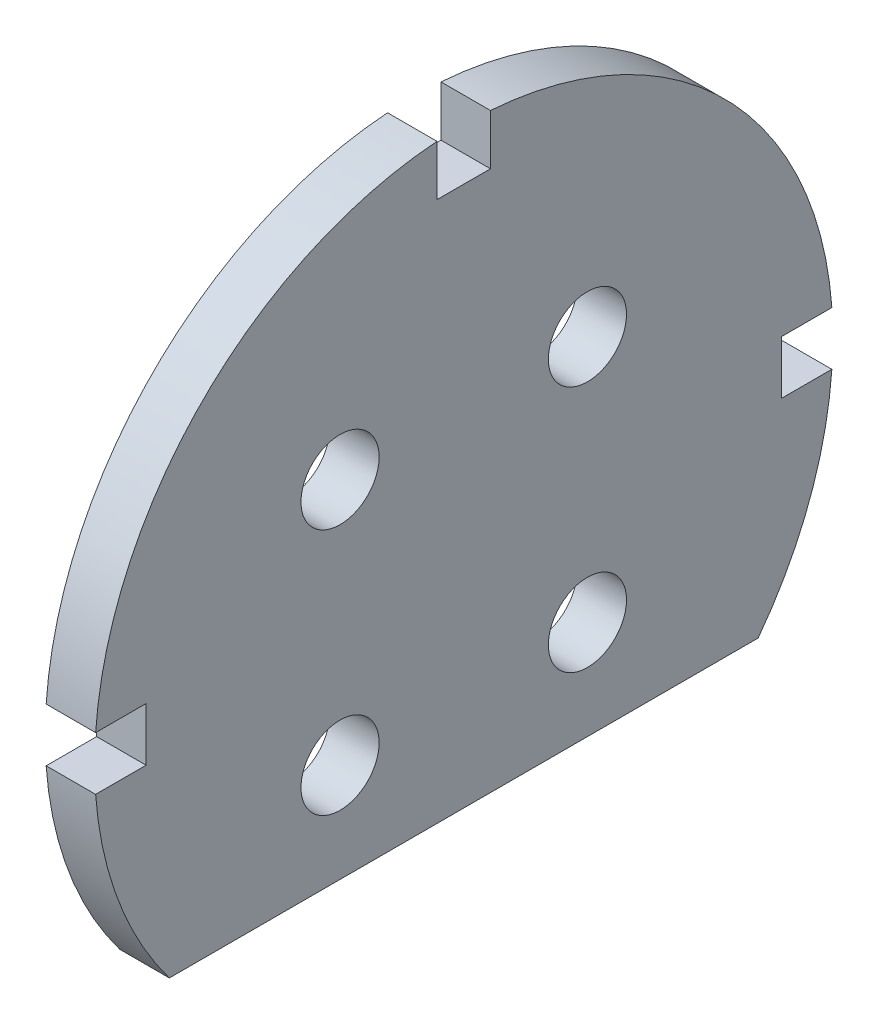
ISO-10303-21;
HEADER;
FILE_DESCRIPTION(('STEP AP214'),'2;1');
FILE_NAME('part.step','',(''),(''),'','','');
FILE_SCHEMA(('AUTOMOTIVE_DESIGN { 1 0 10303 214 1 1 1 1 }'));
ENDSEC;
DATA;
#1=APPLICATION_CONTEXT('core data for automotive mechanical design processes');
#2=APPLICATION_PROTOCOL_DEFINITION('international standard','automotive_design',2000,#1);
#3=PRODUCT_CONTEXT('',#1,'mechanical');
#4=PRODUCT('Part','Part','',(#3));
#5=PRODUCT_RELATED_PRODUCT_CATEGORY('part','',(#4));
#6=PRODUCT_DEFINITION_FORMATION('','',#4);
#7=PRODUCT_DEFINITION_CONTEXT('part definition',#1,'design');
#8=PRODUCT_DEFINITION('design','',#6,#7);
#9=PRODUCT_DEFINITION_SHAPE('','',#8);
#10=(LENGTH_UNIT() NAMED_UNIT(*) SI_UNIT(.MILLI.,.METRE.));
#11=(NAMED_UNIT(*) PLANE_ANGLE_UNIT() SI_UNIT($,.RADIAN.));
#12=(NAMED_UNIT(*) SI_UNIT($,.STERADIAN.) SOLID_ANGLE_UNIT());
#13=UNCERTAINTY_MEASURE_WITH_UNIT(LENGTH_MEASURE(1.E-05),#10,'distance_accuracy_value','');
#14=(GEOMETRIC_REPRESENTATION_CONTEXT(3) GLOBAL_UNCERTAINTY_ASSIGNED_CONTEXT((#13)) GLOBAL_UNIT_ASSIGNED_CONTEXT((#10,
#11,#12)) REPRESENTATION_CONTEXT('',''));
#15=CARTESIAN_POINT('',(0.,0.,0.));
#16=DIRECTION('',(0.,0.,1.));
#17=DIRECTION('',(1.,0.,0.));
#18=AXIS2_PLACEMENT_3D('',#15,#16,#17);
#19=CARTESIAN_POINT('',(6.35,0.,0.));
#20=DIRECTION('',(-1.,0.,0.));
#21=DIRECTION('',(0.,0.,1.));
#22=AXIS2_PLACEMENT_3D('',#19,#20,#21);
#23=CYLINDRICAL_SURFACE('',#22,47.371);
#24=CARTESIAN_POINT('',(0.,0.,0.));
#25=DIRECTION('',(1.,0.,0.));
#26=DIRECTION('',(0.,0.,-1.));
#27=AXIS2_PLACEMENT_3D('',#24,#25,#26);
#28=CIRCLE('',#27,47.371);
#29=CARTESIAN_POINT('',(0.,3.429,-47.2467311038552));
#30=VERTEX_POINT('',#29);
#31=CARTESIAN_POINT('',(0.,47.2467311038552,-3.429));
#32=VERTEX_POINT('',#31);
#33=EDGE_CURVE('E310',#30,#32,#28,.T.);
#34=ORIENTED_EDGE('',*,*,#33,.T.);
#35=DIRECTION('',(-1.,0.,0.));
#36=VECTOR('',#35,1.);
#37=CARTESIAN_POINT('',(6.35,47.2467311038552,-3.429));
#38=LINE('',#37,#36);
#39=CARTESIAN_POINT('',(6.35,47.2467311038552,-3.429));
#40=VERTEX_POINT('',#39);
#41=EDGE_CURVE('E160',#32,#40,#38,.F.);
#42=ORIENTED_EDGE('',*,*,#41,.T.);
#43=CARTESIAN_POINT('',(6.35,0.,0.));
#44=DIRECTION('',(1.,0.,0.));
#45=DIRECTION('',(0.,0.,-1.));
#46=AXIS2_PLACEMENT_3D('',#43,#44,#45);
#47=CIRCLE('',#46,47.371);
#48=CARTESIAN_POINT('',(6.35,3.429,-47.2467311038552));
#49=VERTEX_POINT('',#48);
#50=EDGE_CURVE('E303',#49,#40,#47,.T.);
#51=ORIENTED_EDGE('',*,*,#50,.F.);
#52=DIRECTION('',(-1.,0.,0.));
#53=VECTOR('',#52,1.);
#54=CARTESIAN_POINT('',(6.35,3.429,-47.2467311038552));
#55=LINE('',#54,#53);
#56=EDGE_CURVE('E239',#49,#30,#55,.T.);
#57=ORIENTED_EDGE('',*,*,#56,.T.);
#58=EDGE_LOOP('',(#34,#42,#51,#57));
#59=FACE_BOUND('',#58,.T.);
#60=ADVANCED_FACE('F42',(#59),#23,.T.);
#61=CARTESIAN_POINT('',(6.35,-3.429,47.2467311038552));
#62=VERTEX_POINT('',#61);
#63=CARTESIAN_POINT('',(6.35,-28.575,37.7820197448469));
#64=VERTEX_POINT('',#63);
#65=EDGE_CURVE('E309',#62,#64,#47,.T.);
#66=ORIENTED_EDGE('',*,*,#65,.F.);
#67=DIRECTION('',(-1.,0.,0.));
#68=VECTOR('',#67,1.);
#69=CARTESIAN_POINT('',(6.35,-3.429,47.2467311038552));
#70=LINE('',#69,#68);
#71=CARTESIAN_POINT('',(0.,-3.429,47.2467311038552));
#72=VERTEX_POINT('',#71);
#73=EDGE_CURVE('E246',#62,#72,#70,.T.);
#74=ORIENTED_EDGE('',*,*,#73,.T.);
#75=CARTESIAN_POINT('',(0.,-28.575,37.7820197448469));
#76=VERTEX_POINT('',#75);
#77=EDGE_CURVE('E295',#72,#76,#28,.T.);
#78=ORIENTED_EDGE('',*,*,#77,.T.);
#79=DIRECTION('',(1.,0.,0.));
#80=VECTOR('',#79,1.);
#81=CARTESIAN_POINT('',(0.,-28.575,37.7820197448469));
#82=LINE('',#81,#80);
#83=EDGE_CURVE('E291',#76,#64,#82,.T.);
#84=ORIENTED_EDGE('',*,*,#83,.T.);
#85=EDGE_LOOP('',(#66,#74,#78,#84));
#86=FACE_BOUND('',#85,.T.);
#87=ADVANCED_FACE('F322',(#86),#23,.T.);
#88=CARTESIAN_POINT('',(6.35,47.2467311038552,3.429));
#89=VERTEX_POINT('',#88);
#90=CARTESIAN_POINT('',(6.35,3.429,47.2467311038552));
#91=VERTEX_POINT('',#90);
#92=EDGE_CURVE('E304',#89,#91,#47,.T.);
#93=ORIENTED_EDGE('',*,*,#92,.F.);
#94=DIRECTION('',(-1.,0.,0.));
#95=VECTOR('',#94,1.);
#96=CARTESIAN_POINT('',(6.35,47.2467311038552,3.429));
#97=LINE('',#96,#95);
#98=CARTESIAN_POINT('',(0.,47.2467311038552,3.429));
#99=VERTEX_POINT('',#98);
#100=EDGE_CURVE('E153',#89,#99,#97,.T.);
#101=ORIENTED_EDGE('',*,*,#100,.T.);
#102=CARTESIAN_POINT('',(0.,3.429,47.2467311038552));
#103=VERTEX_POINT('',#102);
#104=EDGE_CURVE('E66',#99,#103,#28,.T.);
#105=ORIENTED_EDGE('',*,*,#104,.T.);
#106=DIRECTION('',(-1.,0.,0.));
#107=VECTOR('',#106,1.);
#108=CARTESIAN_POINT('',(6.35,3.429,47.2467311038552));
#109=LINE('',#108,#107);
#110=EDGE_CURVE('E243',#103,#91,#109,.F.);
#111=ORIENTED_EDGE('',*,*,#110,.T.);
#112=EDGE_LOOP('',(#93,#101,#105,#111));
#113=FACE_BOUND('',#112,.T.);
#114=ADVANCED_FACE('F370',(#113),#23,.T.);
#115=CARTESIAN_POINT('',(0.,-28.575,-37.7820197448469));
#116=VERTEX_POINT('',#115);
#117=CARTESIAN_POINT('',(0.,-3.429,-47.2467311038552));
#118=VERTEX_POINT('',#117);
#119=EDGE_CURVE('E305',#116,#118,#28,.T.);
#120=ORIENTED_EDGE('',*,*,#119,.T.);
#121=DIRECTION('',(-1.,0.,0.));
#122=VECTOR('',#121,1.);
#123=CARTESIAN_POINT('',(6.35,-3.429,-47.2467311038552));
#124=LINE('',#123,#122);
#125=CARTESIAN_POINT('',(6.35,-3.429,-47.2467311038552));
#126=VERTEX_POINT('',#125);
#127=EDGE_CURVE('E210',#118,#126,#124,.F.);
#128=ORIENTED_EDGE('',*,*,#127,.T.);
#129=CARTESIAN_POINT('',(6.35,-28.575,-37.7820197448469));
#130=VERTEX_POINT('',#129);
#131=EDGE_CURVE('E298',#130,#126,#47,.T.);
#132=ORIENTED_EDGE('',*,*,#131,.F.);
#133=DIRECTION('',(1.,0.,0.));
#134=VECTOR('',#133,1.);
#135=CARTESIAN_POINT('',(0.,-28.575,-37.7820197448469));
#136=LINE('',#135,#134);
#137=EDGE_CURVE('E287',#116,#130,#136,.T.);
#138=ORIENTED_EDGE('',*,*,#137,.F.);
#139=EDGE_LOOP('',(#120,#128,#132,#138));
#140=FACE_BOUND('',#139,.T.);
#141=ADVANCED_FACE('F44',(#140),#23,.T.);
#142=CARTESIAN_POINT('',(6.35,0.,0.));
#143=DIRECTION('',(1.,0.,0.));
#144=DIRECTION('',(0.,0.,-1.));
#145=AXIS2_PLACEMENT_3D('',#142,#143,#144);
#146=PLANE('',#145);
#147=DIRECTION('',(0.,1.,0.));
#148=VECTOR('',#147,1.);
#149=CARTESIAN_POINT('',(6.35,53.975,-3.429));
#150=LINE('',#149,#148);
#151=CARTESIAN_POINT('',(6.35,40.767,-3.429));
#152=VERTEX_POINT('',#151);
#153=EDGE_CURVE('E172',#152,#40,#150,.T.);
#154=ORIENTED_EDGE('',*,*,#153,.F.);
#155=DIRECTION('',(0.,0.,-1.));
#156=VECTOR('',#155,1.);
#157=CARTESIAN_POINT('',(6.35,40.767,3.429));
#158=LINE('',#157,#156);
#159=CARTESIAN_POINT('',(6.35,40.767,3.429));
#160=VERTEX_POINT('',#159);
#161=EDGE_CURVE('E149',#160,#152,#158,.T.);
#162=ORIENTED_EDGE('',*,*,#161,.F.);
#163=DIRECTION('',(0.,-1.,0.));
#164=VECTOR('',#163,1.);
#165=CARTESIAN_POINT('',(6.35,53.975,3.429));
#166=LINE('',#165,#164);
#167=EDGE_CURVE('E175',#89,#160,#166,.T.);
#168=ORIENTED_EDGE('',*,*,#167,.F.);
#169=ORIENTED_EDGE('',*,*,#92,.T.);
#170=DIRECTION('',(0.,0.,1.));
#171=VECTOR('',#170,1.);
#172=CARTESIAN_POINT('',(6.35,3.429,53.975));
#173=LINE('',#172,#171);
#174=CARTESIAN_POINT('',(6.35,3.429,40.767));
#175=VERTEX_POINT('',#174);
#176=EDGE_CURVE('E199',#175,#91,#173,.T.);
#177=ORIENTED_EDGE('',*,*,#176,.F.);
#178=DIRECTION('',(0.,1.,0.));
#179=VECTOR('',#178,1.);
#180=CARTESIAN_POINT('',(6.35,-3.429,40.767));
#181=LINE('',#180,#179);
#182=CARTESIAN_POINT('',(6.35,-3.429,40.767));
#183=VERTEX_POINT('',#182);
#184=EDGE_CURVE('E195',#183,#175,#181,.T.);
#185=ORIENTED_EDGE('',*,*,#184,.F.);
#186=DIRECTION('',(0.,0.,-1.));
#187=VECTOR('',#186,1.);
#188=CARTESIAN_POINT('',(6.35,-3.429,53.975));
#189=LINE('',#188,#187);
#190=EDGE_CURVE('E190',#62,#183,#189,.T.);
#191=ORIENTED_EDGE('',*,*,#190,.F.);
#192=ORIENTED_EDGE('',*,*,#65,.T.);
#193=DIRECTION('',(0.,0.,1.));
#194=VECTOR('',#193,1.);
#195=CARTESIAN_POINT('',(6.35,-28.575,37.7820197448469));
#196=LINE('',#195,#194);
#197=EDGE_CURVE('E279',#130,#64,#196,.T.);
#198=ORIENTED_EDGE('',*,*,#197,.F.);
#199=ORIENTED_EDGE('',*,*,#131,.T.);
#200=DIRECTION('',(0.,0.,-1.));
#201=VECTOR('',#200,1.);
#202=CARTESIAN_POINT('',(6.35,-3.429,-53.975));
#203=LINE('',#202,#201);
#204=CARTESIAN_POINT('',(6.35,-3.429,-40.767));
#205=VERTEX_POINT('',#204);
#206=EDGE_CURVE('E223',#205,#126,#203,.T.);
#207=ORIENTED_EDGE('',*,*,#206,.F.);
#208=DIRECTION('',(0.,-1.,0.));
#209=VECTOR('',#208,1.);
#210=CARTESIAN_POINT('',(6.35,3.429,-40.767));
#211=LINE('',#210,#209);
#212=CARTESIAN_POINT('',(6.35,3.429,-40.767));
#213=VERTEX_POINT('',#212);
#214=EDGE_CURVE('E200',#213,#205,#211,.T.);
#215=ORIENTED_EDGE('',*,*,#214,.F.);
#216=DIRECTION('',(0.,0.,1.));
#217=VECTOR('',#216,1.);
#218=CARTESIAN_POINT('',(6.35,3.429,-53.975));
#219=LINE('',#218,#217);
#220=EDGE_CURVE('E220',#49,#213,#219,.T.);
#221=ORIENTED_EDGE('',*,*,#220,.F.);
#222=ORIENTED_EDGE('',*,*,#50,.T.);
#223=EDGE_LOOP('',(#154,#162,#168,#169,#177,#185,#191,#192,#198,#199,#207,#215,#221,#222));
#224=FACE_BOUND('',#223,.T.);
#225=CARTESIAN_POINT('',(6.35,-15.875,15.875));
#226=DIRECTION('',(1.,0.,0.));
#227=DIRECTION('',(0.,0.,-1.));
#228=AXIS2_PLACEMENT_3D('',#225,#226,#227);
#229=CIRCLE('',#228,5.0165);
#230=CARTESIAN_POINT('',(6.35,-15.875,10.8585));
#231=VERTEX_POINT('',#230);
#232=EDGE_CURVE('E268',#231,#231,#229,.T.);
#233=ORIENTED_EDGE('',*,*,#232,.F.);
#234=EDGE_LOOP('',(#233));
#235=FACE_BOUND('',#234,.T.);
#236=CARTESIAN_POINT('',(6.35,-15.875,-15.875));
#237=DIRECTION('',(1.,0.,0.));
#238=DIRECTION('',(0.,0.,-1.));
#239=AXIS2_PLACEMENT_3D('',#236,#237,#238);
#240=CIRCLE('',#239,5.0165);
#241=CARTESIAN_POINT('',(6.35,-15.875,-20.8915));
#242=VERTEX_POINT('',#241);
#243=EDGE_CURVE('E260',#242,#242,#240,.T.);
#244=ORIENTED_EDGE('',*,*,#243,.F.);
#245=EDGE_LOOP('',(#244));
#246=FACE_BOUND('',#245,.T.);
#247=CARTESIAN_POINT('',(6.35,15.875,-15.875));
#248=DIRECTION('',(1.,0.,0.));
#249=DIRECTION('',(0.,0.,-1.));
#250=AXIS2_PLACEMENT_3D('',#247,#248,#249);
#251=CIRCLE('',#250,5.0165);
#252=CARTESIAN_POINT('',(6.35,15.875,-20.8915));
#253=VERTEX_POINT('',#252);
#254=EDGE_CURVE('E251',#253,#253,#251,.T.);
#255=ORIENTED_EDGE('',*,*,#254,.F.);
#256=EDGE_LOOP('',(#255));
#257=FACE_BOUND('',#256,.T.);
#258=CARTESIAN_POINT('',(6.35,15.875,15.875));
#259=DIRECTION('',(1.,0.,0.));
#260=DIRECTION('',(0.,0.,-1.));
#261=AXIS2_PLACEMENT_3D('',#258,#259,#260);
#262=CIRCLE('',#261,5.0165);
#263=CARTESIAN_POINT('',(6.35,15.875,10.8585));
#264=VERTEX_POINT('',#263);
#265=EDGE_CURVE('E255',#264,#264,#262,.T.);
#266=ORIENTED_EDGE('',*,*,#265,.F.);
#267=EDGE_LOOP('',(#266));
#268=FACE_BOUND('',#267,.T.);
#269=ADVANCED_FACE('F332',(#224,#235,#246,#257,#268),#146,.T.);
#270=CARTESIAN_POINT('',(0.,0.,0.));
#271=DIRECTION('',(1.,0.,0.));
#272=DIRECTION('',(0.,0.,-1.));
#273=AXIS2_PLACEMENT_3D('',#270,#271,#272);
#274=PLANE('',#273);
#275=CARTESIAN_POINT('',(0.,-15.875,15.875));
#276=DIRECTION('',(1.,0.,0.));
#277=DIRECTION('',(0.,0.,-1.));
#278=AXIS2_PLACEMENT_3D('',#275,#276,#277);
#279=CIRCLE('',#278,5.0165);
#280=CARTESIAN_POINT('',(0.,-15.875,10.8585));
#281=VERTEX_POINT('',#280);
#282=EDGE_CURVE('E250',#281,#281,#279,.T.);
#283=ORIENTED_EDGE('',*,*,#282,.T.);
#284=EDGE_LOOP('',(#283));
#285=FACE_BOUND('',#284,.T.);
#286=CARTESIAN_POINT('',(0.,-15.875,-15.875));
#287=DIRECTION('',(1.,0.,0.));
#288=DIRECTION('',(0.,0.,-1.));
#289=AXIS2_PLACEMENT_3D('',#286,#287,#288);
#290=CIRCLE('',#289,5.0165);
#291=CARTESIAN_POINT('',(0.,-15.875,-20.8915));
#292=VERTEX_POINT('',#291);
#293=EDGE_CURVE('E264',#292,#292,#290,.T.);
#294=ORIENTED_EDGE('',*,*,#293,.T.);
#295=EDGE_LOOP('',(#294));
#296=FACE_BOUND('',#295,.T.);
#297=CARTESIAN_POINT('',(0.,15.875,-15.875));
#298=DIRECTION('',(1.,0.,0.));
#299=DIRECTION('',(0.,0.,-1.));
#300=AXIS2_PLACEMENT_3D('',#297,#298,#299);
#301=CIRCLE('',#300,5.0165);
#302=CARTESIAN_POINT('',(0.,15.875,-20.8915));
#303=VERTEX_POINT('',#302);
#304=EDGE_CURVE('E256',#303,#303,#301,.T.);
#305=ORIENTED_EDGE('',*,*,#304,.T.);
#306=EDGE_LOOP('',(#305));
#307=FACE_BOUND('',#306,.T.);
#308=CARTESIAN_POINT('',(0.,15.875,15.875));
#309=DIRECTION('',(1.,0.,0.));
#310=DIRECTION('',(0.,0.,-1.));
#311=AXIS2_PLACEMENT_3D('',#308,#309,#310);
#312=CIRCLE('',#311,5.0165);
#313=CARTESIAN_POINT('',(0.,15.875,10.8585));
#314=VERTEX_POINT('',#313);
#315=EDGE_CURVE('E275',#314,#314,#312,.T.);
#316=ORIENTED_EDGE('',*,*,#315,.T.);
#317=EDGE_LOOP('',(#316));
#318=FACE_BOUND('',#317,.T.);
#319=DIRECTION('',(0.,0.,-1.));
#320=VECTOR('',#319,1.);
#321=CARTESIAN_POINT('',(0.,40.767,3.429));
#322=LINE('',#321,#320);
#323=CARTESIAN_POINT('',(0.,40.767,3.429));
#324=VERTEX_POINT('',#323);
#325=CARTESIAN_POINT('',(0.,40.767,-3.429));
#326=VERTEX_POINT('',#325);
#327=EDGE_CURVE('E58',#324,#326,#322,.T.);
#328=ORIENTED_EDGE('',*,*,#327,.T.);
#329=DIRECTION('',(0.,1.,0.));
#330=VECTOR('',#329,1.);
#331=CARTESIAN_POINT('',(0.,53.975,-3.429));
#332=LINE('',#331,#330);
#333=EDGE_CURVE('E157',#326,#32,#332,.T.);
#334=ORIENTED_EDGE('',*,*,#333,.T.);
#335=ORIENTED_EDGE('',*,*,#33,.F.);
#336=DIRECTION('',(0.,0.,1.));
#337=VECTOR('',#336,1.);
#338=CARTESIAN_POINT('',(0.,3.429,0.));
#339=LINE('',#338,#337);
#340=CARTESIAN_POINT('',(0.,3.429,-40.767));
#341=VERTEX_POINT('',#340);
#342=EDGE_CURVE('E302',#30,#341,#339,.T.);
#343=ORIENTED_EDGE('',*,*,#342,.T.);
#344=DIRECTION('',(0.,-1.,0.));
#345=VECTOR('',#344,1.);
#346=CARTESIAN_POINT('',(0.,3.429,-40.767));
#347=LINE('',#346,#345);
#348=CARTESIAN_POINT('',(0.,-3.429,-40.767));
#349=VERTEX_POINT('',#348);
#350=EDGE_CURVE('E224',#341,#349,#347,.T.);
#351=ORIENTED_EDGE('',*,*,#350,.T.);
#352=DIRECTION('',(0.,0.,-1.));
#353=VECTOR('',#352,1.);
#354=CARTESIAN_POINT('',(0.,-3.429,-53.975));
#355=LINE('',#354,#353);
#356=EDGE_CURVE('E216',#349,#118,#355,.T.);
#357=ORIENTED_EDGE('',*,*,#356,.T.);
#358=ORIENTED_EDGE('',*,*,#119,.F.);
#359=DIRECTION('',(0.,0.,1.));
#360=VECTOR('',#359,1.);
#361=CARTESIAN_POINT('',(0.,-28.575,37.7820197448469));
#362=LINE('',#361,#360);
#363=EDGE_CURVE('E283',#116,#76,#362,.T.);
#364=ORIENTED_EDGE('',*,*,#363,.T.);
#365=ORIENTED_EDGE('',*,*,#77,.F.);
#366=DIRECTION('',(0.,0.,-1.));
#367=VECTOR('',#366,1.);
#368=CARTESIAN_POINT('',(0.,-3.429,0.));
#369=LINE('',#368,#367);
#370=CARTESIAN_POINT('',(0.,-3.429,40.767));
#371=VERTEX_POINT('',#370);
#372=EDGE_CURVE('E51',#72,#371,#369,.T.);
#373=ORIENTED_EDGE('',*,*,#372,.T.);
#374=DIRECTION('',(0.,1.,0.));
#375=VECTOR('',#374,1.);
#376=CARTESIAN_POINT('',(0.,-3.429,40.767));
#377=LINE('',#376,#375);
#378=CARTESIAN_POINT('',(0.,3.429,40.767));
#379=VERTEX_POINT('',#378);
#380=EDGE_CURVE('E185',#371,#379,#377,.T.);
#381=ORIENTED_EDGE('',*,*,#380,.T.);
#382=DIRECTION('',(0.,0.,1.));
#383=VECTOR('',#382,1.);
#384=CARTESIAN_POINT('',(0.,3.429,53.975));
#385=LINE('',#384,#383);
#386=EDGE_CURVE('E189',#379,#103,#385,.T.);
#387=ORIENTED_EDGE('',*,*,#386,.T.);
#388=ORIENTED_EDGE('',*,*,#104,.F.);
#389=DIRECTION('',(0.,-1.,0.));
#390=VECTOR('',#389,1.);
#391=CARTESIAN_POINT('',(0.,0.,3.429));
#392=LINE('',#391,#390);
#393=EDGE_CURVE('E11',#99,#324,#392,.T.);
#394=ORIENTED_EDGE('',*,*,#393,.T.);
#395=EDGE_LOOP('',(#328,#334,#335,#343,#351,#357,#358,#364,#365,#373,#381,#387,#388,#394));
#396=FACE_BOUND('',#395,.T.);
#397=ADVANCED_FACE('F166',(#285,#296,#307,#318,#396),#274,.F.);
#398=CARTESIAN_POINT('',(0.,-28.575,37.7820197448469));
#399=DIRECTION('',(0.,1.,0.));
#400=DIRECTION('',(0.,0.,1.));
#401=AXIS2_PLACEMENT_3D('',#398,#399,#400);
#402=PLANE('',#401);
#403=ORIENTED_EDGE('',*,*,#197,.T.);
#404=ORIENTED_EDGE('',*,*,#83,.F.);
#405=ORIENTED_EDGE('',*,*,#363,.F.);
#406=ORIENTED_EDGE('',*,*,#137,.T.);
#407=EDGE_LOOP('',(#403,#404,#405,#406));
#408=FACE_BOUND('',#407,.T.);
#409=ADVANCED_FACE('F353',(#408),#402,.F.);
#410=CARTESIAN_POINT('',(0.,15.875,15.875));
#411=DIRECTION('',(1.,0.,0.));
#412=DIRECTION('',(0.,0.,-1.));
#413=AXIS2_PLACEMENT_3D('',#410,#411,#412);
#414=CYLINDRICAL_SURFACE('',#413,5.0165);
#415=ORIENTED_EDGE('',*,*,#315,.F.);
#416=EDGE_LOOP('',(#415));
#417=FACE_BOUND('',#416,.T.);
#418=ORIENTED_EDGE('',*,*,#265,.T.);
#419=EDGE_LOOP('',(#418));
#420=FACE_BOUND('',#419,.T.);
#421=ADVANCED_FACE('F355',(#417,#420),#414,.F.);
#422=CARTESIAN_POINT('',(0.,15.875,-15.875));
#423=DIRECTION('',(1.,0.,0.));
#424=DIRECTION('',(0.,0.,-1.));
#425=AXIS2_PLACEMENT_3D('',#422,#423,#424);
#426=CYLINDRICAL_SURFACE('',#425,5.0165);
#427=ORIENTED_EDGE('',*,*,#304,.F.);
#428=EDGE_LOOP('',(#427));
#429=FACE_BOUND('',#428,.T.);
#430=ORIENTED_EDGE('',*,*,#254,.T.);
#431=EDGE_LOOP('',(#430));
#432=FACE_BOUND('',#431,.T.);
#433=ADVANCED_FACE('F361',(#429,#432),#426,.F.);
#434=CARTESIAN_POINT('',(0.,-15.875,-15.875));
#435=DIRECTION('',(1.,0.,0.));
#436=DIRECTION('',(0.,0.,-1.));
#437=AXIS2_PLACEMENT_3D('',#434,#435,#436);
#438=CYLINDRICAL_SURFACE('',#437,5.0165);
#439=ORIENTED_EDGE('',*,*,#293,.F.);
#440=EDGE_LOOP('',(#439));
#441=FACE_BOUND('',#440,.T.);
#442=ORIENTED_EDGE('',*,*,#243,.T.);
#443=EDGE_LOOP('',(#442));
#444=FACE_BOUND('',#443,.T.);
#445=ADVANCED_FACE('F407',(#441,#444),#438,.F.);
#446=CARTESIAN_POINT('',(0.,-15.875,15.875));
#447=DIRECTION('',(1.,0.,0.));
#448=DIRECTION('',(0.,0.,-1.));
#449=AXIS2_PLACEMENT_3D('',#446,#447,#448);
#450=CYLINDRICAL_SURFACE('',#449,5.0165);
#451=ORIENTED_EDGE('',*,*,#282,.F.);
#452=EDGE_LOOP('',(#451));
#453=FACE_BOUND('',#452,.T.);
#454=ORIENTED_EDGE('',*,*,#232,.T.);
#455=EDGE_LOOP('',(#454));
#456=FACE_BOUND('',#455,.T.);
#457=ADVANCED_FACE('F404',(#453,#456),#450,.F.);
#458=CARTESIAN_POINT('',(0.,3.429,-53.975));
#459=DIRECTION('',(0.,1.,0.));
#460=DIRECTION('',(0.,0.,1.));
#461=AXIS2_PLACEMENT_3D('',#458,#459,#460);
#462=PLANE('',#461);
#463=ORIENTED_EDGE('',*,*,#220,.T.);
#464=DIRECTION('',(1.,0.,0.));
#465=VECTOR('',#464,1.);
#466=CARTESIAN_POINT('',(0.,3.429,-40.767));
#467=LINE('',#466,#465);
#468=EDGE_CURVE('E184',#341,#213,#467,.T.);
#469=ORIENTED_EDGE('',*,*,#468,.F.);
#470=ORIENTED_EDGE('',*,*,#342,.F.);
#471=ORIENTED_EDGE('',*,*,#56,.F.);
#472=EDGE_LOOP('',(#463,#469,#470,#471));
#473=FACE_BOUND('',#472,.T.);
#474=ADVANCED_FACE('F341',(#473),#462,.F.);
#475=CARTESIAN_POINT('',(0.,-3.429,-53.975));
#476=DIRECTION('',(0.,-1.,0.));
#477=DIRECTION('',(0.,0.,-1.));
#478=AXIS2_PLACEMENT_3D('',#475,#476,#477);
#479=PLANE('',#478);
#480=ORIENTED_EDGE('',*,*,#356,.F.);
#481=DIRECTION('',(1.,0.,0.));
#482=VECTOR('',#481,1.);
#483=CARTESIAN_POINT('',(0.,-3.429,-40.767));
#484=LINE('',#483,#482);
#485=EDGE_CURVE('E213',#349,#205,#484,.T.);
#486=ORIENTED_EDGE('',*,*,#485,.T.);
#487=ORIENTED_EDGE('',*,*,#206,.T.);
#488=ORIENTED_EDGE('',*,*,#127,.F.);
#489=EDGE_LOOP('',(#480,#486,#487,#488));
#490=FACE_BOUND('',#489,.T.);
#491=ADVANCED_FACE('F347',(#490),#479,.F.);
#492=CARTESIAN_POINT('',(0.,3.429,-40.767));
#493=DIRECTION('',(0.,0.,1.));
#494=DIRECTION('',(1.,0.,0.));
#495=AXIS2_PLACEMENT_3D('',#492,#493,#494);
#496=PLANE('',#495);
#497=ORIENTED_EDGE('',*,*,#214,.T.);
#498=ORIENTED_EDGE('',*,*,#485,.F.);
#499=ORIENTED_EDGE('',*,*,#350,.F.);
#500=ORIENTED_EDGE('',*,*,#468,.T.);
#501=EDGE_LOOP('',(#497,#498,#499,#500));
#502=FACE_BOUND('',#501,.T.);
#503=ADVANCED_FACE('F343',(#502),#496,.F.);
#504=CARTESIAN_POINT('',(0.,-3.429,53.975));
#505=DIRECTION('',(0.,-1.,0.));
#506=DIRECTION('',(0.,0.,-1.));
#507=AXIS2_PLACEMENT_3D('',#504,#505,#506);
#508=PLANE('',#507);
#509=ORIENTED_EDGE('',*,*,#190,.T.);
#510=DIRECTION('',(1.,0.,0.));
#511=VECTOR('',#510,1.);
#512=CARTESIAN_POINT('',(0.,-3.429,40.767));
#513=LINE('',#512,#511);
#514=EDGE_CURVE('E206',#371,#183,#513,.T.);
#515=ORIENTED_EDGE('',*,*,#514,.F.);
#516=ORIENTED_EDGE('',*,*,#372,.F.);
#517=ORIENTED_EDGE('',*,*,#73,.F.);
#518=EDGE_LOOP('',(#509,#515,#516,#517));
#519=FACE_BOUND('',#518,.T.);
#520=ADVANCED_FACE('F318',(#519),#508,.F.);
#521=CARTESIAN_POINT('',(0.,3.429,53.975));
#522=DIRECTION('',(0.,1.,0.));
#523=DIRECTION('',(0.,0.,1.));
#524=AXIS2_PLACEMENT_3D('',#521,#522,#523);
#525=PLANE('',#524);
#526=ORIENTED_EDGE('',*,*,#386,.F.);
#527=DIRECTION('',(1.,0.,0.));
#528=VECTOR('',#527,1.);
#529=CARTESIAN_POINT('',(0.,3.429,40.767));
#530=LINE('',#529,#528);
#531=EDGE_CURVE('E194',#379,#175,#530,.T.);
#532=ORIENTED_EDGE('',*,*,#531,.T.);
#533=ORIENTED_EDGE('',*,*,#176,.T.);
#534=ORIENTED_EDGE('',*,*,#110,.F.);
#535=EDGE_LOOP('',(#526,#532,#533,#534));
#536=FACE_BOUND('',#535,.T.);
#537=ADVANCED_FACE('F384',(#536),#525,.F.);
#538=CARTESIAN_POINT('',(0.,-3.429,40.767));
#539=DIRECTION('',(0.,0.,-1.));
#540=DIRECTION('',(-1.,0.,0.));
#541=AXIS2_PLACEMENT_3D('',#538,#539,#540);
#542=PLANE('',#541);
#543=ORIENTED_EDGE('',*,*,#184,.T.);
#544=ORIENTED_EDGE('',*,*,#531,.F.);
#545=ORIENTED_EDGE('',*,*,#380,.F.);
#546=ORIENTED_EDGE('',*,*,#514,.T.);
#547=EDGE_LOOP('',(#543,#544,#545,#546));
#548=FACE_BOUND('',#547,.T.);
#549=ADVANCED_FACE('F386',(#548),#542,.F.);
#550=CARTESIAN_POINT('',(0.,53.975,-3.429));
#551=DIRECTION('',(0.,0.,-1.));
#552=DIRECTION('',(0.,1.,0.));
#553=AXIS2_PLACEMENT_3D('',#550,#551,#552);
#554=PLANE('',#553);
#555=ORIENTED_EDGE('',*,*,#333,.F.);
#556=DIRECTION('',(1.,0.,0.));
#557=VECTOR('',#556,1.);
#558=CARTESIAN_POINT('',(0.,40.767,-3.429));
#559=LINE('',#558,#557);
#560=EDGE_CURVE('E145',#326,#152,#559,.T.);
#561=ORIENTED_EDGE('',*,*,#560,.T.);
#562=ORIENTED_EDGE('',*,*,#153,.T.);
#563=ORIENTED_EDGE('',*,*,#41,.F.);
#564=EDGE_LOOP('',(#555,#561,#562,#563));
#565=FACE_BOUND('',#564,.T.);
#566=ADVANCED_FACE('F158',(#565),#554,.F.);
#567=CARTESIAN_POINT('',(0.,53.975,3.429));
#568=DIRECTION('',(0.,0.,1.));
#569=DIRECTION('',(0.,-1.,0.));
#570=AXIS2_PLACEMENT_3D('',#567,#568,#569);
#571=PLANE('',#570);
#572=ORIENTED_EDGE('',*,*,#167,.T.);
#573=DIRECTION('',(1.,0.,0.));
#574=VECTOR('',#573,1.);
#575=CARTESIAN_POINT('',(0.,40.767,3.429));
#576=LINE('',#575,#574);
#577=EDGE_CURVE('E154',#324,#160,#576,.T.);
#578=ORIENTED_EDGE('',*,*,#577,.F.);
#579=ORIENTED_EDGE('',*,*,#393,.F.);
#580=ORIENTED_EDGE('',*,*,#100,.F.);
#581=EDGE_LOOP('',(#572,#578,#579,#580));
#582=FACE_BOUND('',#581,.T.);
#583=ADVANCED_FACE('F393',(#582),#571,.F.);
#584=CARTESIAN_POINT('',(0.,40.767,3.429));
#585=DIRECTION('',(0.,-1.,0.));
#586=DIRECTION('',(0.,0.,-1.));
#587=AXIS2_PLACEMENT_3D('',#584,#585,#586);
#588=PLANE('',#587);
#589=ORIENTED_EDGE('',*,*,#161,.T.);
#590=ORIENTED_EDGE('',*,*,#560,.F.);
#591=ORIENTED_EDGE('',*,*,#327,.F.);
#592=ORIENTED_EDGE('',*,*,#577,.T.);
#593=EDGE_LOOP('',(#589,#590,#591,#592));
#594=FACE_BOUND('',#593,.T.);
#595=ADVANCED_FACE('F147',(#594),#588,.F.);
#596=CLOSED_SHELL('',(#60,#87,#114,#141,#269,#397,#409,#421,#433,#445,#457,#474,#491,#503,#520,
#537,#549,#566,#583,#595));
#597=MANIFOLD_SOLID_BREP('B2',#596);
#598=ADVANCED_BREP_SHAPE_REPRESENTATION('',(#18,#597),#14);
#599=SHAPE_DEFINITION_REPRESENTATION(#9,#598);
ENDSEC;
END-ISO-10303-21;
